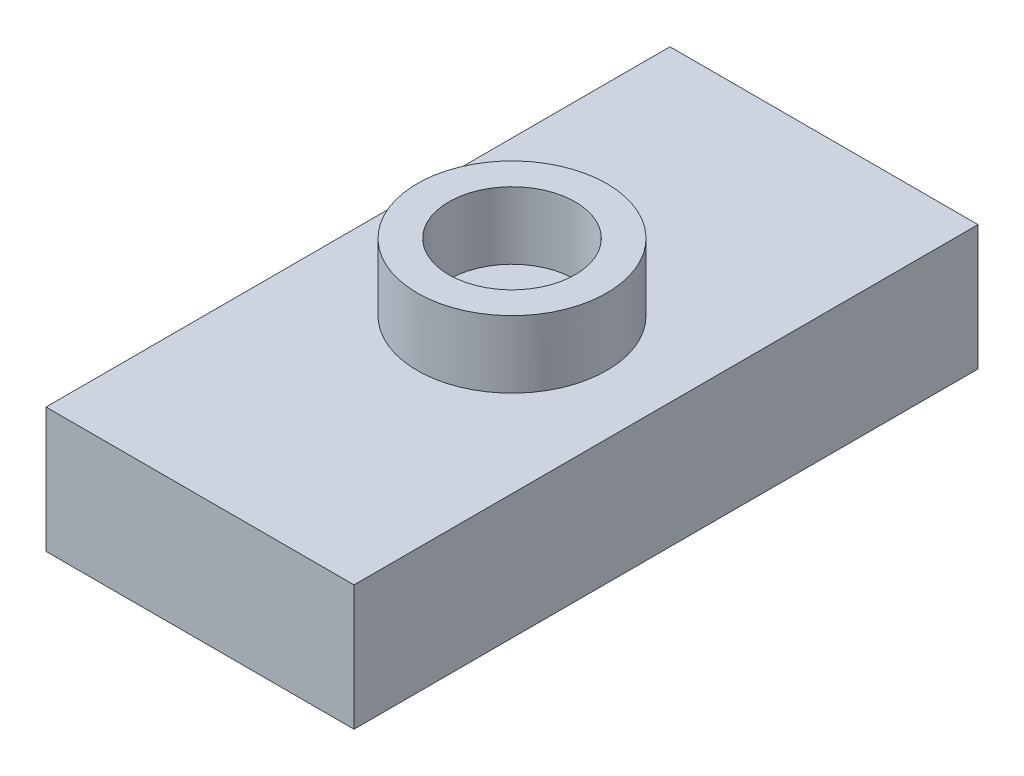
from build123d import *

# Parameters (mm, degrees)
SKETCH1_W           = 7.8
SKETCH1_H           = 15.8
EXTRUDE1_DEPTH      = 3.166
SKETCH3_W           = 4.9
SKETCH3_H           = 4.9
EXTRUDE3_DEPTH      = 2.5
LPATTERN2_COUNT     = 2
LPATTERN2_PITCH     = 8
SKETCH5_R           = 2.4
SKETCH5_R_2         = 1.6
BOSS_EXTRUDE1_DEPTH = 1.7


with BuildPart() as part:
    # Sketch1 → Extrude1 (new body)
    with BuildSketch(Plane(origin=(0, 0, 0), x_dir=(1, 0, 0), z_dir=(0, 1, 0))):
        with Locations((3.9, 7.9)):
            Rectangle(SKETCH1_W, SKETCH1_H)
    extrude(amount=EXTRUDE1_DEPTH)

    # Sketch3 → Extrude3 (cut)
    with BuildSketch(Plane.XZ):
        with Locations((3.9, -11.9)):
            Rectangle(SKETCH3_W, SKETCH3_H)
    extrude3 = extrude(amount=-EXTRUDE3_DEPTH, mode=Mode.SUBTRACT)

    # LPattern2: Extrude3 ×2
    with Locations(*[(0, 0, i * LPATTERN2_PITCH) for i in range(1, LPATTERN2_COUNT)]):
        add(extrude3, mode=Mode.SUBTRACT)

    # Sketch5 → Boss-Extrude1 (add)
    with BuildSketch(Plane(origin=(0, 3.166, 0), x_dir=(1, 0, 0), z_dir=(0, 1, 0))):
        with Locations(Location((3.9, 7.9, 0), (0, 0, 90))):
            Circle(SKETCH5_R)
        with Locations(Location((3.9, 7.9, 0), (0, 0, 270))):
            Circle(SKETCH5_R_2, mode=Mode.SUBTRACT)
    extrude(amount=BOSS_EXTRUDE1_DEPTH)


solid = part.part
